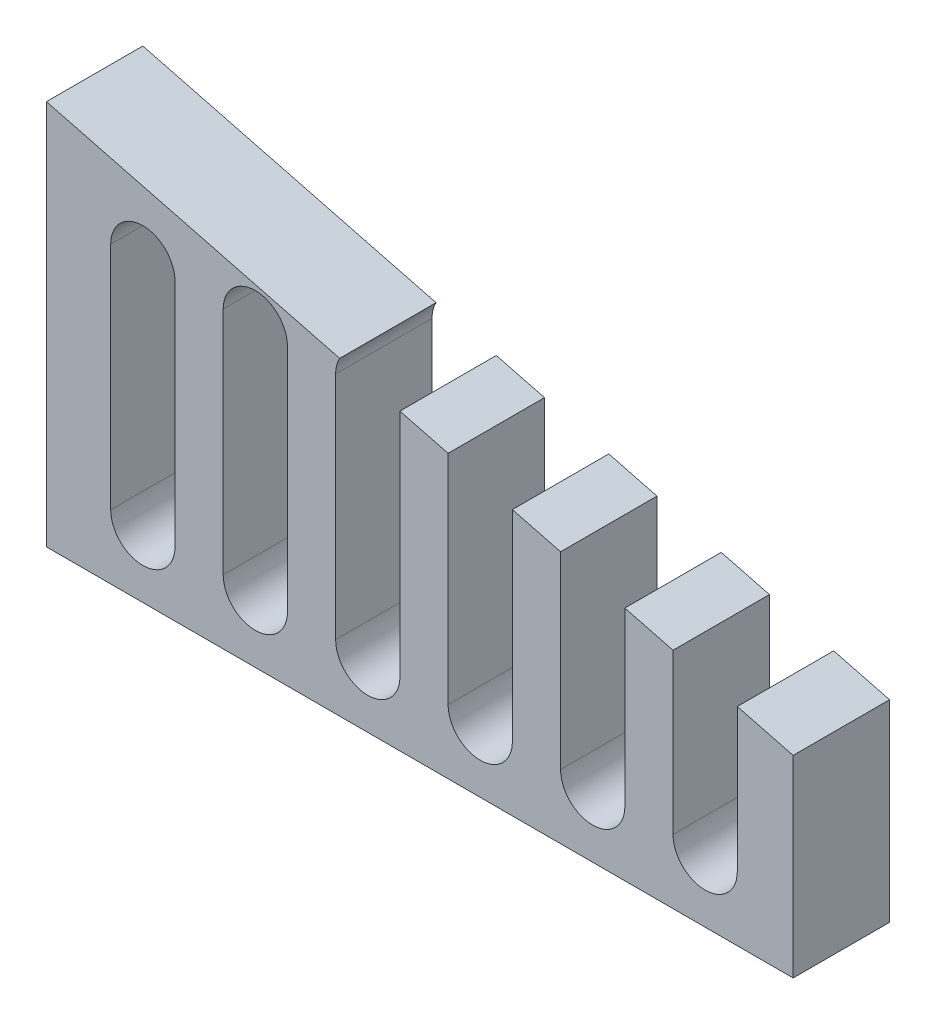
from build123d import *

# Parameters (mm, degrees)
EXTRUDE1_DEPTH     = 9.525
CUT_EXTRUDE1_DEPTH = 84.58153579
LPATTERN1_COUNT    = 6
LPATTERN1_PITCH    = 11.1125


with BuildPart() as part:
    # Sketch1 → Extrude1 (new body)
    with BuildSketch(Plane(origin=(0, 0, 0), x_dir=(1, 0, 0), z_dir=(0, 0, -1))):
        Polygon((0, -38.1), (73.780332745, -19.05), (73.780332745, 0), (0, 0), align=None)
    extrude(amount=EXTRUDE1_DEPTH)

    # Sketch2 → Cut-Extrude1 (cut, through all)
    with BuildSketch(Plane(origin=(0, 0, -9.525), x_dir=(1, 0, 0), z_dir=(0, 0, -1))):
        with BuildLine():
            Line((6.35, -6.35), (6.35, -29.082403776))
            ThreePointArc((6.35, -29.082403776), (9.525, -32.257403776), (12.7, -29.082403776))
            Line((12.7, -29.082403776), (12.7, -6.35))
            ThreePointArc((12.7, -6.35), (9.525, -3.175), (6.35, -6.35))
        make_face()
    cut_extrude1 = extrude(amount=-CUT_EXTRUDE1_DEPTH, mode=Mode.SUBTRACT)

    # LPattern1: Cut-Extrude1 ×6
    with Locations(*[(i * LPATTERN1_PITCH, 0, 0) for i in range(1, LPATTERN1_COUNT)]):
        add(cut_extrude1, mode=Mode.SUBTRACT)


solid = part.part
